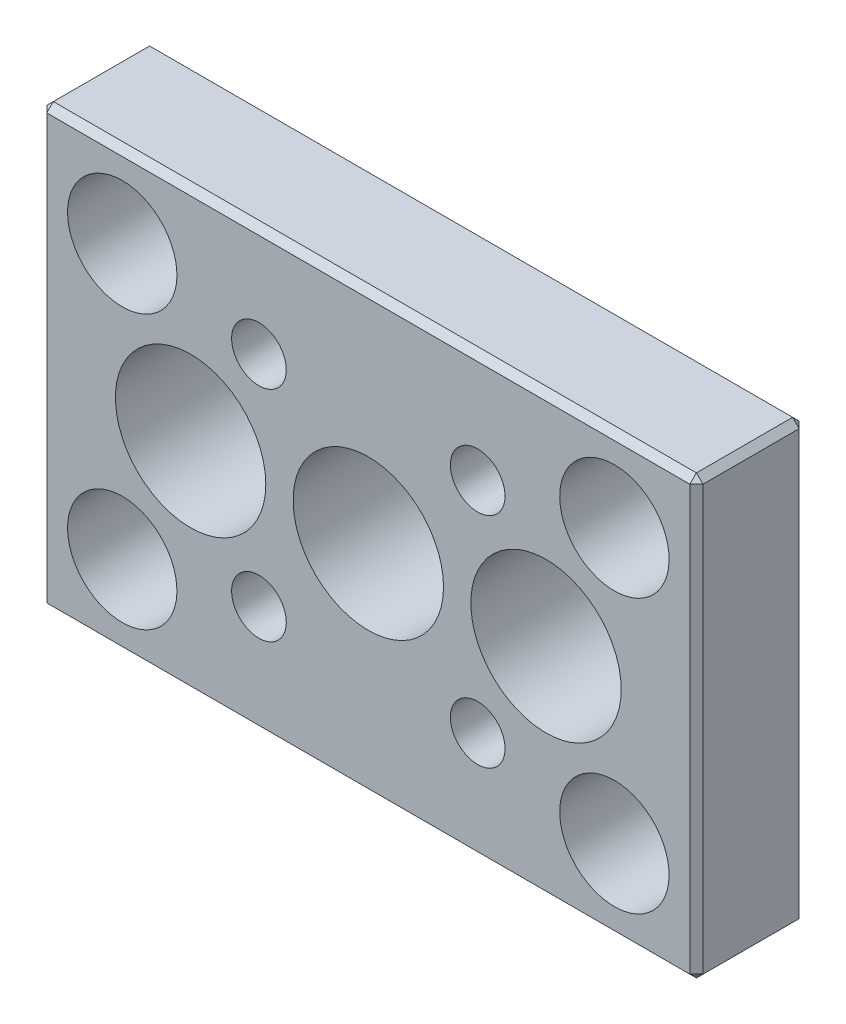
from build123d import *

# Parameters (mm, degrees)
SKETCH1_W            = 152.4
SKETCH1_H            = 101.6
EXTRUDE1_DEPTH       = 25.4
SKETCH2_R            = 6.35
CUT_EXTRUDE2_DEPTH   = 96.038097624
LPATTERN1_COUNT      = 2
LPATTERN1_PITCH      = 50.8
LPATTERN1_COUNT_DIR2 = 2
LPATTERN1_PITCH_DIR2 = 50.8
SKETCH3_R            = 12.7
CUT_EXTRUDE3_DEPTH   = 96.038097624
LPATTERN2_COUNT      = 2
LPATTERN2_PITCH      = 63.5
LPATTERN2_COUNT_DIR2 = 2
LPATTERN2_PITCH_DIR2 = 114.3
CHAMFER1_SIZE        = 1.524
SKETCH4_R            = 17.4625
CUT_EXTRUDE5_DEPTH   = 96.038097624
LPATTERN3_COUNT      = 3
LPATTERN3_PITCH      = 41.275


with BuildPart() as part:
    # Sketch1 → Extrude1 (new body)
    with BuildSketch(Plane.XY):
        Rectangle(SKETCH1_W, SKETCH1_H)
    extrude(amount=-EXTRUDE1_DEPTH)

    # Sketch2 → Cut-Extrude2 (cut, through all)
    with BuildSketch(Plane(origin=(0, 0, -25.4), x_dir=(1, 0, 0), z_dir=(0, 0, -1))):
        with Locations(Location((-25.4, -25.4, 0), (0, 0, 270))):
            Circle(SKETCH2_R)
    cut_extrude2 = extrude(amount=-CUT_EXTRUDE2_DEPTH, mode=Mode.SUBTRACT)

    # LPattern1: Cut-Extrude2 2 × 2
    with Locations(*[(i * LPATTERN1_PITCH, -j * LPATTERN1_PITCH_DIR2, 0) for i in range(LPATTERN1_COUNT) for j in range(LPATTERN1_COUNT_DIR2) if (i, j) != (0, 0)]):
        add(cut_extrude2, mode=Mode.SUBTRACT)

    # Sketch3 → Cut-Extrude3 (cut, through all)
    with BuildSketch(Plane(origin=(0, 0, -25.4), x_dir=(1, 0, 0), z_dir=(0, 0, -1))):
        with Locations(Location((57.15, 31.75, 0), (0, 0, 270))):
            Circle(SKETCH3_R)
    cut_extrude3 = extrude(amount=-CUT_EXTRUDE3_DEPTH, mode=Mode.SUBTRACT)

    # LPattern2: Cut-Extrude3 2 × 2
    with Locations(*[(-j * LPATTERN2_PITCH_DIR2, i * LPATTERN2_PITCH, 0) for i in range(LPATTERN2_COUNT) for j in range(LPATTERN2_COUNT_DIR2) if (i, j) != (0, 0)]):
        add(cut_extrude3, mode=Mode.SUBTRACT)

    # Chamfer1
    chamfer1_edges = [part.edges().sort_by_distance(p)[0] for p in [
        (76.2, 0, -25.4),
        (0, 50.8, -25.4),
        (-76.2, 0, -25.4),
        (0, 50.8, 0),
        (76.2, 0, 0),
        (0, -50.8, 0),
        (-76.2, 0, 0),
        (0, -50.8, -25.4),
        (-76.2, 50.8, -12.7),
        (76.2, 50.8, -12.7),
        (76.2, -50.8, -12.7),
        (-76.2, -50.8, -12.7),
    ]]
    chamfer(chamfer1_edges, length=CHAMFER1_SIZE)

    # Sketch4 → Cut-Extrude5 (cut, through all)
    with BuildSketch(Plane.XY):
        with Locations((41.275, 0)):
            Circle(SKETCH4_R)
    cut_extrude5 = extrude(amount=-CUT_EXTRUDE5_DEPTH, mode=Mode.SUBTRACT)

    # LPattern3: Cut-Extrude5 ×3
    with Locations(*[(-i * LPATTERN3_PITCH, 0, 0) for i in range(1, LPATTERN3_COUNT)]):
        add(cut_extrude5, mode=Mode.SUBTRACT)


solid = part.part
